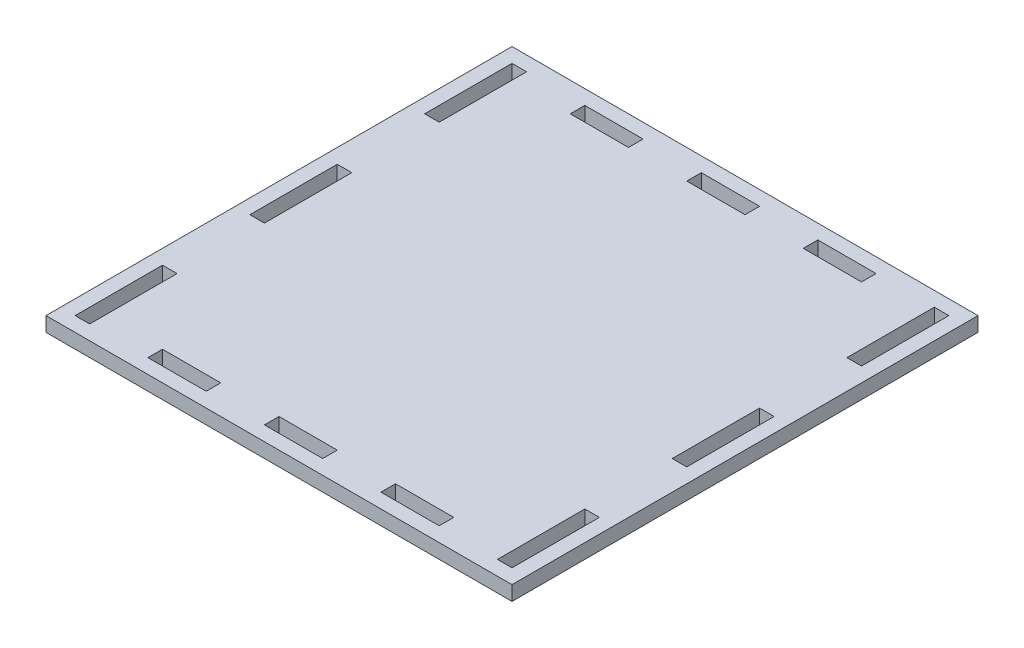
from build123d import *

# Parameters (mm, degrees)
SKETCH1_W           = 406.4
SKETCH1_H           = 406.4
BOSS_EXTRUDE1_DEPTH = 12.7
SKETCH2_W           = 12.7
SKETCH2_H           = 76.2
CUT_EXTRUDE1_DEPTH  = 575.876691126
SKETCH3_W           = 50.8
SKETCH3_H           = 12.7
CUT_EXTRUDE2_DEPTH  = 575.876691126


with BuildPart() as part:
    # Sketch1 → Boss-Extrude1 (new body)
    with BuildSketch(Plane(origin=(0, 0, 0), x_dir=(1, 0, 0), z_dir=(0, 1, 0))):
        with Locations((203.2, 203.2)):
            Rectangle(SKETCH1_W, SKETCH1_H)
    extrude(amount=-BOSS_EXTRUDE1_DEPTH)

    # Sketch2 → Cut-Extrude1 (cut, through all)
    with BuildSketch(Plane(origin=(0, 0, 0), x_dir=(-1, 0, 0), z_dir=(0, 1, 0))):
        with Locations((-387.35, -50.8)):
            Rectangle(SKETCH2_W, SKETCH2_H)
        with Locations((-387.35, -203.2)):
            Rectangle(SKETCH2_W, SKETCH2_H)
        with Locations((-387.35, -355.6)):
            Rectangle(SKETCH2_W, SKETCH2_H)
        with Locations((-19.05, -50.8)):
            Rectangle(SKETCH2_W, SKETCH2_H)
        with Locations((-19.05, -203.2)):
            Rectangle(SKETCH2_W, SKETCH2_H)
        with Locations((-19.05, -355.6)):
            Rectangle(SKETCH2_W, SKETCH2_H)
    extrude(amount=-CUT_EXTRUDE1_DEPTH, mode=Mode.SUBTRACT)

    # Sketch3 → Cut-Extrude2 (cut, through all)
    with BuildSketch(Plane(origin=(0, 0, 0), x_dir=(-1, 0, 0), z_dir=(0, 1, 0))):
        with Locations((-101.6, -19.05)):
            Rectangle(SKETCH3_W, SKETCH3_H)
        with Locations((-203.2, -19.05)):
            Rectangle(SKETCH3_W, SKETCH3_H)
        with Locations((-304.8, -19.05)):
            Rectangle(SKETCH3_W, SKETCH3_H)
        with Locations((-101.6, -387.35)):
            Rectangle(SKETCH3_W, SKETCH3_H)
        with Locations((-203.2, -387.35)):
            Rectangle(SKETCH3_W, SKETCH3_H)
        with Locations((-304.8, -387.35)):
            Rectangle(SKETCH3_W, SKETCH3_H)
    extrude(amount=-CUT_EXTRUDE2_DEPTH, mode=Mode.SUBTRACT)


solid = part.part
